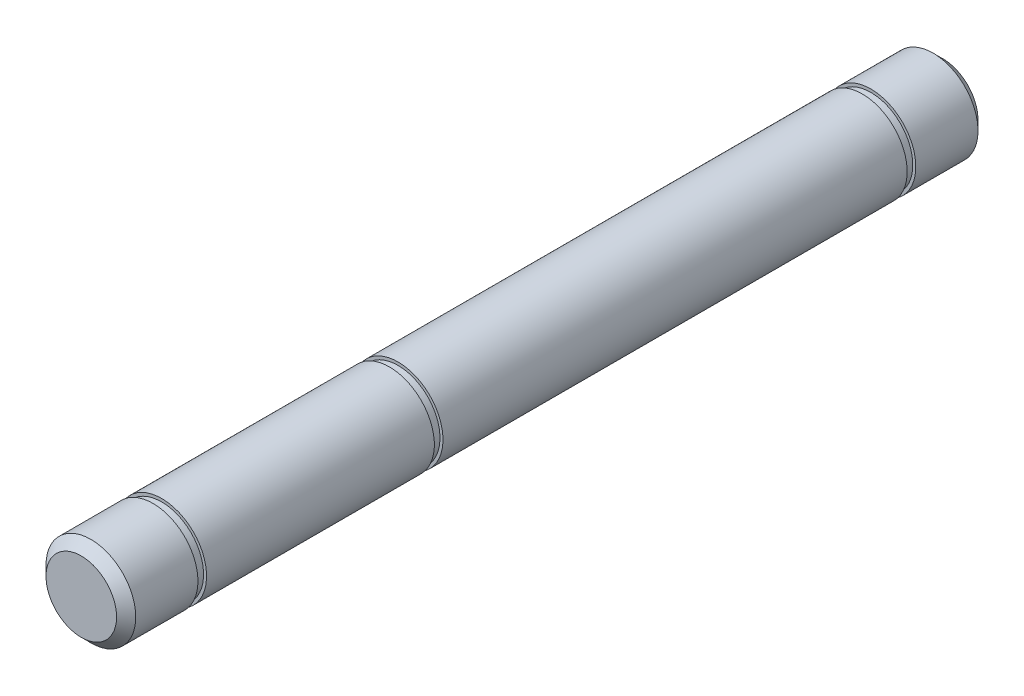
ISO-10303-21;
HEADER;
FILE_DESCRIPTION(('STEP AP214'),'2;1');
FILE_NAME('part.step','',(''),(''),'','','');
FILE_SCHEMA(('AUTOMOTIVE_DESIGN { 1 0 10303 214 1 1 1 1 }'));
ENDSEC;
DATA;
#1=APPLICATION_CONTEXT('core data for automotive mechanical design processes');
#2=APPLICATION_PROTOCOL_DEFINITION('international standard','automotive_design',2000,#1);
#3=PRODUCT_CONTEXT('',#1,'mechanical');
#4=PRODUCT('Part','Part','',(#3));
#5=PRODUCT_RELATED_PRODUCT_CATEGORY('part','',(#4));
#6=PRODUCT_DEFINITION_FORMATION('','',#4);
#7=PRODUCT_DEFINITION_CONTEXT('part definition',#1,'design');
#8=PRODUCT_DEFINITION('design','',#6,#7);
#9=PRODUCT_DEFINITION_SHAPE('','',#8);
#10=(LENGTH_UNIT() NAMED_UNIT(*) SI_UNIT(.MILLI.,.METRE.));
#11=(NAMED_UNIT(*) PLANE_ANGLE_UNIT() SI_UNIT($,.RADIAN.));
#12=(NAMED_UNIT(*) SI_UNIT($,.STERADIAN.) SOLID_ANGLE_UNIT());
#13=UNCERTAINTY_MEASURE_WITH_UNIT(LENGTH_MEASURE(1.E-05),#10,'distance_accuracy_value','');
#14=(GEOMETRIC_REPRESENTATION_CONTEXT(3) GLOBAL_UNCERTAINTY_ASSIGNED_CONTEXT((#13)) GLOBAL_UNIT_ASSIGNED_CONTEXT((#10,
#11,#12)) REPRESENTATION_CONTEXT('',''));
#15=CARTESIAN_POINT('',(0.,0.,0.));
#16=DIRECTION('',(0.,0.,1.));
#17=DIRECTION('',(1.,0.,0.));
#18=AXIS2_PLACEMENT_3D('',#15,#16,#17);
#19=CARTESIAN_POINT('',(0.,0.,22.86));
#20=DIRECTION('',(0.,0.,-1.));
#21=DIRECTION('',(-1.,0.,0.));
#22=AXIS2_PLACEMENT_3D('',#19,#20,#21);
#23=CYLINDRICAL_SURFACE('',#22,2.38125);
#24=CARTESIAN_POINT('',(0.,0.,18.5928));
#25=DIRECTION('',(0.,0.,-1.));
#26=DIRECTION('',(-1.,0.,0.));
#27=AXIS2_PLACEMENT_3D('',#24,#25,#26);
#28=CIRCLE('',#27,2.38125);
#29=CARTESIAN_POINT('',(-2.38125,0.,18.5928));
#30=VERTEX_POINT('',#29);
#31=EDGE_CURVE('E54',#30,#30,#28,.T.);
#32=ORIENTED_EDGE('',*,*,#31,.T.);
#33=EDGE_LOOP('',(#32));
#34=FACE_BOUND('',#33,.T.);
#35=CARTESIAN_POINT('',(0.,0.,6.50239999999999));
#36=DIRECTION('',(0.,0.,-1.));
#37=DIRECTION('',(-1.,0.,0.));
#38=AXIS2_PLACEMENT_3D('',#35,#36,#37);
#39=CIRCLE('',#38,2.38125);
#40=CARTESIAN_POINT('',(-2.38125,0.,6.50239999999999));
#41=VERTEX_POINT('',#40);
#42=EDGE_CURVE('E75',#41,#41,#39,.T.);
#43=ORIENTED_EDGE('',*,*,#42,.F.);
#44=EDGE_LOOP('',(#43));
#45=FACE_BOUND('',#44,.T.);
#46=ADVANCED_FACE('F28',(#34,#45),#23,.T.);
#47=CARTESIAN_POINT('',(0.,0.,22.352));
#48=DIRECTION('',(0.,0.,1.));
#49=DIRECTION('',(1.,0.,0.));
#50=AXIS2_PLACEMENT_3D('',#47,#48,#49);
#51=CIRCLE('',#50,2.38125);
#52=CARTESIAN_POINT('',(2.38125,0.,22.352));
#53=VERTEX_POINT('',#52);
#54=EDGE_CURVE('E39',#53,#53,#51,.F.);
#55=ORIENTED_EDGE('',*,*,#54,.T.);
#56=EDGE_LOOP('',(#55));
#57=FACE_BOUND('',#56,.T.);
#58=CARTESIAN_POINT('',(0.,0.,19.05));
#59=DIRECTION('',(0.,0.,-1.));
#60=DIRECTION('',(-1.,0.,0.));
#61=AXIS2_PLACEMENT_3D('',#58,#59,#60);
#62=CIRCLE('',#61,2.38125);
#63=CARTESIAN_POINT('',(-2.38125,0.,19.05));
#64=VERTEX_POINT('',#63);
#65=EDGE_CURVE('E51',#64,#64,#62,.T.);
#66=ORIENTED_EDGE('',*,*,#65,.F.);
#67=EDGE_LOOP('',(#66));
#68=FACE_BOUND('',#67,.T.);
#69=ADVANCED_FACE('F30',(#57,#68),#23,.T.);
#70=CARTESIAN_POINT('',(0.,0.,22.86));
#71=DIRECTION('',(0.,0.,1.));
#72=DIRECTION('',(1.,0.,0.));
#73=AXIS2_PLACEMENT_3D('',#70,#71,#72);
#74=PLANE('',#73);
#75=CARTESIAN_POINT('',(0.,0.,22.86));
#76=DIRECTION('',(0.,0.,1.));
#77=DIRECTION('',(1.,0.,0.));
#78=AXIS2_PLACEMENT_3D('',#75,#76,#77);
#79=CIRCLE('',#78,1.87325);
#80=CARTESIAN_POINT('',(1.87325,0.,22.86));
#81=VERTEX_POINT('',#80);
#82=EDGE_CURVE('E43',#81,#81,#79,.T.);
#83=ORIENTED_EDGE('',*,*,#82,.T.);
#84=EDGE_LOOP('',(#83));
#85=FACE_BOUND('',#84,.T.);
#86=ADVANCED_FACE('F110',(#85),#74,.T.);
#87=CARTESIAN_POINT('',(0.,0.,15.4422688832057));
#88=DIRECTION('',(0.,0.,-1.));
#89=DIRECTION('',(-1.,0.,0.));
#90=AXIS2_PLACEMENT_3D('',#87,#88,#89);
#91=CYLINDRICAL_SURFACE('',#90,2.2225);
#92=CARTESIAN_POINT('',(0.,0.,19.05));
#93=DIRECTION('',(0.,0.,-1.));
#94=DIRECTION('',(-1.,0.,0.));
#95=AXIS2_PLACEMENT_3D('',#92,#93,#94);
#96=CIRCLE('',#95,2.2225);
#97=CARTESIAN_POINT('',(-2.2225,0.,19.05));
#98=VERTEX_POINT('',#97);
#99=EDGE_CURVE('E48',#98,#98,#96,.T.);
#100=ORIENTED_EDGE('',*,*,#99,.T.);
#101=EDGE_LOOP('',(#100));
#102=FACE_BOUND('',#101,.T.);
#103=CARTESIAN_POINT('',(0.,0.,18.5928));
#104=DIRECTION('',(0.,0.,-1.));
#105=DIRECTION('',(-1.,0.,0.));
#106=AXIS2_PLACEMENT_3D('',#103,#104,#105);
#107=CIRCLE('',#106,2.2225);
#108=CARTESIAN_POINT('',(-2.2225,0.,18.5928));
#109=VERTEX_POINT('',#108);
#110=EDGE_CURVE('E57',#109,#109,#107,.T.);
#111=ORIENTED_EDGE('',*,*,#110,.F.);
#112=EDGE_LOOP('',(#111));
#113=FACE_BOUND('',#112,.T.);
#114=ADVANCED_FACE('F157',(#102,#113),#91,.T.);
#115=CARTESIAN_POINT('',(2.2225,0.,19.05));
#116=DIRECTION('',(0.,0.,-1.));
#117=DIRECTION('',(-1.,0.,0.));
#118=AXIS2_PLACEMENT_3D('',#115,#116,#117);
#119=PLANE('',#118);
#120=ORIENTED_EDGE('',*,*,#65,.T.);
#121=EDGE_LOOP('',(#120));
#122=FACE_BOUND('',#121,.T.);
#123=ORIENTED_EDGE('',*,*,#99,.F.);
#124=EDGE_LOOP('',(#123));
#125=FACE_BOUND('',#124,.T.);
#126=ADVANCED_FACE('F153',(#122,#125),#119,.T.);
#127=CARTESIAN_POINT('',(2.2225,0.,18.5928));
#128=DIRECTION('',(0.,0.,1.));
#129=DIRECTION('',(1.,0.,0.));
#130=AXIS2_PLACEMENT_3D('',#127,#128,#129);
#131=PLANE('',#130);
#132=ORIENTED_EDGE('',*,*,#110,.T.);
#133=EDGE_LOOP('',(#132));
#134=FACE_BOUND('',#133,.T.);
#135=ORIENTED_EDGE('',*,*,#31,.F.);
#136=EDGE_LOOP('',(#135));
#137=FACE_BOUND('',#136,.T.);
#138=ADVANCED_FACE('F100',(#134,#137),#131,.T.);
#139=CARTESIAN_POINT('',(0.,0.,22.86));
#140=DIRECTION('',(0.,0.,-1.));
#141=DIRECTION('',(-1.,0.,0.));
#142=AXIS2_PLACEMENT_3D('',#139,#140,#141);
#143=CONICAL_SURFACE('',#142,1.87325,0.785398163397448);
#144=ORIENTED_EDGE('',*,*,#54,.F.);
#145=EDGE_LOOP('',(#144));
#146=FACE_BOUND('',#145,.T.);
#147=ORIENTED_EDGE('',*,*,#82,.F.);
#148=EDGE_LOOP('',(#147));
#149=FACE_BOUND('',#148,.T.);
#150=ADVANCED_FACE('F91',(#146,#149),#143,.T.);
#151=CARTESIAN_POINT('',(0.,0.,4.02060289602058));
#152=DIRECTION('',(0.,0.,-1.));
#153=DIRECTION('',(-1.,0.,0.));
#154=AXIS2_PLACEMENT_3D('',#151,#152,#153);
#155=CYLINDRICAL_SURFACE('',#154,2.2225);
#156=CARTESIAN_POINT('',(0.,0.,6.50239999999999));
#157=DIRECTION('',(0.,0.,-1.));
#158=DIRECTION('',(-1.,0.,0.));
#159=AXIS2_PLACEMENT_3D('',#156,#157,#158);
#160=CIRCLE('',#159,2.2225);
#161=CARTESIAN_POINT('',(-2.2225,0.,6.50239999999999));
#162=VERTEX_POINT('',#161);
#163=EDGE_CURVE('E72',#162,#162,#160,.T.);
#164=ORIENTED_EDGE('',*,*,#163,.T.);
#165=EDGE_LOOP('',(#164));
#166=FACE_BOUND('',#165,.T.);
#167=CARTESIAN_POINT('',(0.,0.,6.0452));
#168=DIRECTION('',(0.,0.,-1.));
#169=DIRECTION('',(-1.,0.,0.));
#170=AXIS2_PLACEMENT_3D('',#167,#168,#169);
#171=CIRCLE('',#170,2.2225);
#172=CARTESIAN_POINT('',(-2.2225,0.,6.0452));
#173=VERTEX_POINT('',#172);
#174=EDGE_CURVE('E81',#173,#173,#171,.T.);
#175=ORIENTED_EDGE('',*,*,#174,.F.);
#176=EDGE_LOOP('',(#175));
#177=FACE_BOUND('',#176,.T.);
#178=ADVANCED_FACE('F88',(#166,#177),#155,.T.);
#179=CARTESIAN_POINT('',(2.2225,0.,6.50239999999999));
#180=DIRECTION('',(0.,0.,-1.));
#181=DIRECTION('',(-1.,0.,0.));
#182=AXIS2_PLACEMENT_3D('',#179,#180,#181);
#183=PLANE('',#182);
#184=ORIENTED_EDGE('',*,*,#42,.T.);
#185=EDGE_LOOP('',(#184));
#186=FACE_BOUND('',#185,.T.);
#187=ORIENTED_EDGE('',*,*,#163,.F.);
#188=EDGE_LOOP('',(#187));
#189=FACE_BOUND('',#188,.T.);
#190=ADVANCED_FACE('F90',(#186,#189),#183,.T.);
#191=CARTESIAN_POINT('',(2.2225,0.,6.0452));
#192=DIRECTION('',(0.,0.,1.));
#193=DIRECTION('',(1.,0.,0.));
#194=AXIS2_PLACEMENT_3D('',#191,#192,#193);
#195=PLANE('',#194);
#196=ORIENTED_EDGE('',*,*,#174,.T.);
#197=EDGE_LOOP('',(#196));
#198=FACE_BOUND('',#197,.T.);
#199=CARTESIAN_POINT('',(0.,0.,6.0452));
#200=DIRECTION('',(0.,0.,-1.));
#201=DIRECTION('',(-1.,0.,0.));
#202=AXIS2_PLACEMENT_3D('',#199,#200,#201);
#203=CIRCLE('',#202,2.38125);
#204=CARTESIAN_POINT('',(-2.38125,0.,6.0452));
#205=VERTEX_POINT('',#204);
#206=EDGE_CURVE('E78',#205,#205,#203,.T.);
#207=ORIENTED_EDGE('',*,*,#206,.F.);
#208=EDGE_LOOP('',(#207));
#209=FACE_BOUND('',#208,.T.);
#210=ADVANCED_FACE('F85',(#198,#209),#195,.T.);
#211=CARTESIAN_POINT('',(0.,0.,-22.86));
#212=DIRECTION('',(0.,0.,-1.));
#213=DIRECTION('',(1.,0.,0.));
#214=AXIS2_PLACEMENT_3D('',#211,#212,#213);
#215=PLANE('',#214);
#216=CARTESIAN_POINT('',(0.,0.,-22.86));
#217=DIRECTION('',(0.,0.,-1.));
#218=DIRECTION('',(-1.,0.,0.));
#219=AXIS2_PLACEMENT_3D('',#216,#217,#218);
#220=CIRCLE('',#219,1.87325);
#221=CARTESIAN_POINT('',(-1.87325,0.,-22.86));
#222=VERTEX_POINT('',#221);
#223=EDGE_CURVE('E10',#222,#222,#220,.T.);
#224=ORIENTED_EDGE('',*,*,#223,.T.);
#225=EDGE_LOOP('',(#224));
#226=FACE_BOUND('',#225,.T.);
#227=ADVANCED_FACE('F134',(#226),#215,.T.);
#228=CARTESIAN_POINT('',(0.,0.,-22.352));
#229=DIRECTION('',(0.,0.,1.));
#230=DIRECTION('',(1.,0.,0.));
#231=AXIS2_PLACEMENT_3D('',#228,#229,#230);
#232=CONICAL_SURFACE('',#231,2.38125,0.785398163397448);
#233=ORIENTED_EDGE('',*,*,#223,.F.);
#234=EDGE_LOOP('',(#233));
#235=FACE_BOUND('',#234,.T.);
#236=CARTESIAN_POINT('',(0.,0.,-22.352));
#237=DIRECTION('',(0.,0.,-1.));
#238=DIRECTION('',(-1.,0.,0.));
#239=AXIS2_PLACEMENT_3D('',#236,#237,#238);
#240=CIRCLE('',#239,2.38125);
#241=CARTESIAN_POINT('',(-2.38125,0.,-22.352));
#242=VERTEX_POINT('',#241);
#243=EDGE_CURVE('E35',#242,#242,#240,.F.);
#244=ORIENTED_EDGE('',*,*,#243,.F.);
#245=EDGE_LOOP('',(#244));
#246=FACE_BOUND('',#245,.T.);
#247=ADVANCED_FACE('F127',(#235,#246),#232,.T.);
#248=ORIENTED_EDGE('',*,*,#243,.T.);
#249=EDGE_LOOP('',(#248));
#250=FACE_BOUND('',#249,.T.);
#251=CARTESIAN_POINT('',(0.,0.,-19.05));
#252=DIRECTION('',(0.,0.,-1.));
#253=DIRECTION('',(-1.,0.,0.));
#254=AXIS2_PLACEMENT_3D('',#251,#252,#253);
#255=CIRCLE('',#254,2.38125);
#256=CARTESIAN_POINT('',(-2.38125,0.,-19.05));
#257=VERTEX_POINT('',#256);
#258=EDGE_CURVE('E63',#257,#257,#255,.T.);
#259=ORIENTED_EDGE('',*,*,#258,.T.);
#260=EDGE_LOOP('',(#259));
#261=FACE_BOUND('',#260,.T.);
#262=ADVANCED_FACE('F112',(#250,#261),#23,.T.);
#263=CARTESIAN_POINT('',(2.2225,0.,-19.05));
#264=DIRECTION('',(0.,0.,1.));
#265=DIRECTION('',(-1.,0.,0.));
#266=AXIS2_PLACEMENT_3D('',#263,#264,#265);
#267=PLANE('',#266);
#268=ORIENTED_EDGE('',*,*,#258,.F.);
#269=EDGE_LOOP('',(#268));
#270=FACE_BOUND('',#269,.T.);
#271=CARTESIAN_POINT('',(0.,0.,-19.05));
#272=DIRECTION('',(0.,0.,-1.));
#273=DIRECTION('',(-1.,0.,0.));
#274=AXIS2_PLACEMENT_3D('',#271,#272,#273);
#275=CIRCLE('',#274,2.2225);
#276=CARTESIAN_POINT('',(-2.2225,0.,-19.05));
#277=VERTEX_POINT('',#276);
#278=EDGE_CURVE('E60',#277,#277,#275,.T.);
#279=ORIENTED_EDGE('',*,*,#278,.T.);
#280=EDGE_LOOP('',(#279));
#281=FACE_BOUND('',#280,.T.);
#282=ADVANCED_FACE('F126',(#270,#281),#267,.T.);
#283=CARTESIAN_POINT('',(0.,0.,-15.4422688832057));
#284=DIRECTION('',(0.,0.,1.));
#285=DIRECTION('',(-1.,0.,0.));
#286=AXIS2_PLACEMENT_3D('',#283,#284,#285);
#287=CYLINDRICAL_SURFACE('',#286,2.2225);
#288=ORIENTED_EDGE('',*,*,#278,.F.);
#289=EDGE_LOOP('',(#288));
#290=FACE_BOUND('',#289,.T.);
#291=CARTESIAN_POINT('',(0.,0.,-18.5928));
#292=DIRECTION('',(0.,0.,-1.));
#293=DIRECTION('',(-1.,0.,0.));
#294=AXIS2_PLACEMENT_3D('',#291,#292,#293);
#295=CIRCLE('',#294,2.2225);
#296=CARTESIAN_POINT('',(-2.2225,0.,-18.5928));
#297=VERTEX_POINT('',#296);
#298=EDGE_CURVE('E69',#297,#297,#295,.T.);
#299=ORIENTED_EDGE('',*,*,#298,.T.);
#300=EDGE_LOOP('',(#299));
#301=FACE_BOUND('',#300,.T.);
#302=ADVANCED_FACE('F120',(#290,#301),#287,.T.);
#303=CARTESIAN_POINT('',(2.2225,0.,-18.5928));
#304=DIRECTION('',(0.,0.,-1.));
#305=DIRECTION('',(1.,0.,0.));
#306=AXIS2_PLACEMENT_3D('',#303,#304,#305);
#307=PLANE('',#306);
#308=ORIENTED_EDGE('',*,*,#298,.F.);
#309=EDGE_LOOP('',(#308));
#310=FACE_BOUND('',#309,.T.);
#311=CARTESIAN_POINT('',(0.,0.,-18.5928));
#312=DIRECTION('',(0.,0.,-1.));
#313=DIRECTION('',(-1.,0.,0.));
#314=AXIS2_PLACEMENT_3D('',#311,#312,#313);
#315=CIRCLE('',#314,2.38125);
#316=CARTESIAN_POINT('',(-2.38125,0.,-18.5928));
#317=VERTEX_POINT('',#316);
#318=EDGE_CURVE('E66',#317,#317,#315,.T.);
#319=ORIENTED_EDGE('',*,*,#318,.T.);
#320=EDGE_LOOP('',(#319));
#321=FACE_BOUND('',#320,.T.);
#322=ADVANCED_FACE('F115',(#310,#321),#307,.T.);
#323=ORIENTED_EDGE('',*,*,#318,.F.);
#324=EDGE_LOOP('',(#323));
#325=FACE_BOUND('',#324,.T.);
#326=ORIENTED_EDGE('',*,*,#206,.T.);
#327=EDGE_LOOP('',(#326));
#328=FACE_BOUND('',#327,.T.);
#329=ADVANCED_FACE('F106',(#325,#328),#23,.T.);
#330=CLOSED_SHELL('',(#46,#69,#86,#114,#126,#138,#150,#178,#190,#210,#227,#247,#262,#282,#302,
#322,#329));
#331=MANIFOLD_SOLID_BREP('B2',#330);
#332=ADVANCED_BREP_SHAPE_REPRESENTATION('',(#18,#331),#14);
#333=SHAPE_DEFINITION_REPRESENTATION(#9,#332);
ENDSEC;
END-ISO-10303-21;
